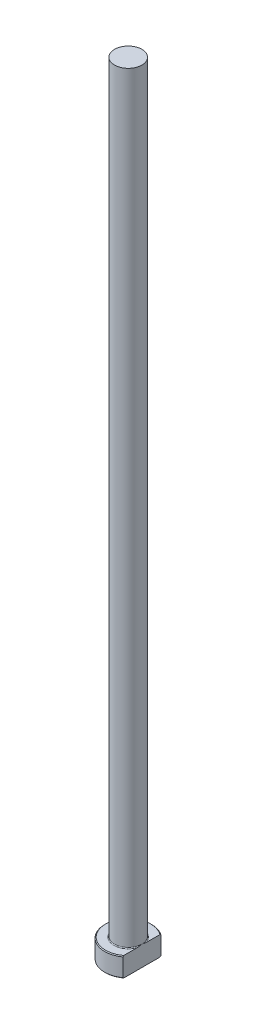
from build123d import *
from build123d.topology import SkipClean

# Parameters (mm, degrees)
CHAMFER1_SIZE = 0.2
FILLET1_R     = 0.2
KEY_DEPTH     = 201.179919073


with BuildPart() as part:
    # Sketch1 → Revolve1 (revolve)
    with BuildSketch(Plane.XY, mode=Mode.PRIVATE) as revolve1_sk:
        Polygon((0, 0), (-6, 0), (-6, 5), (-3.5, 5), (-3.5, 200), (0, 200), align=None)
    revolve(revolve1_sk.sketch.rotate(Axis((0, 259.958771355, 0), (0, -1, 0)), 270), axis=Axis((0, 259.958771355, 0), (0, -1, 0)))

    # Chamfer1
    chamfer1_edges = [part.edges().sort_by_distance(p)[0] for p in [
        (0, 5, -6),
        (0, 0, -6),
    ]]
    chamfer(chamfer1_edges, length=CHAMFER1_SIZE)

    # Fillet1
    fillet1_edges = [part.edges().sort_by_distance(p)[0] for p in [
        (0, 5, -3.5),
    ]]
    fillet(fillet1_edges, radius=FILLET1_R)

    # Sketch2 → KEY (cut, through all)
    with SkipClean():  # the faces are left unmerged after this step: merging them gives an invalid solid
        with BuildSketch(Plane(origin=(0, 0, 0), x_dir=(1, 0, 0), z_dir=(0, 1, 0))):
            with BuildLine():
                Line((3.5, 4.873397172), (3.5, -4.873397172))
                ThreePointArc((3.5, -4.873397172), (6, 0), (3.5, 4.873397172))
            make_face()
        extrude(amount=KEY_DEPTH, mode=Mode.SUBTRACT)


solid = part.part
